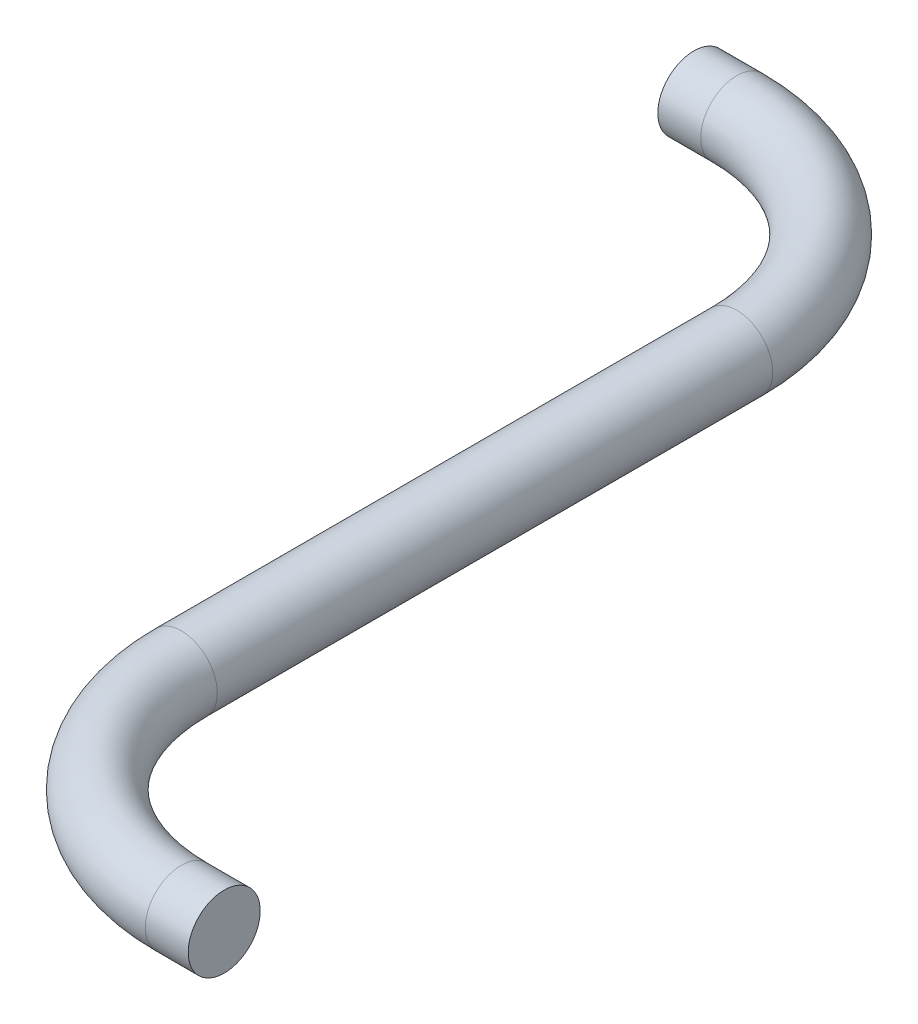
from build123d import *

# Parameters (mm, degrees)
SKETCH1_R = 1.5875


with BuildPart() as part:
    # Sweep1: sweep along a path in Sketch2
    with BuildLine(Plane(origin=(0, 0, 0), x_dir=(1, 0, 0), z_dir=(0, 1, 0))) as sweep1_path:
        Line((0, 0), (1.891990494, 0))
        ThreePointArc((1.891990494, 0), (8.223289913, -2.622510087), (10.8458, -8.953809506))
        Line((10.8458, -8.953809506), (10.8458, -33.444481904))
        ThreePointArc((10.8458, -33.444481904), (13.468310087, -39.775781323), (19.799609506, -42.398291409))
        Line((19.799609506, -42.398291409), (21.6916, -42.398291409))
    # Sketch1 → Sweep1 (sweep)
    with BuildSketch(Plane(origin=(0, 0, 0), x_dir=(0, 0, -1), z_dir=(1, 0, 0))):
        with Locations((0, 1.5875)):
            Circle(SKETCH1_R)
    sweep(path=sweep1_path.line)


solid = part.part
